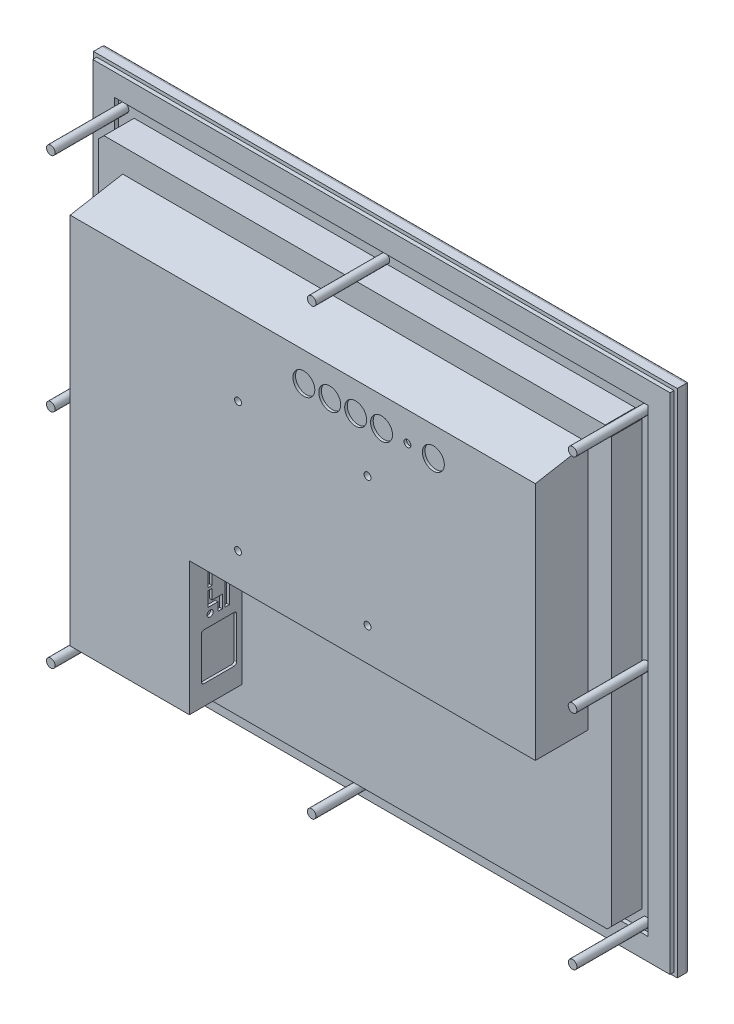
from build123d import *

# Parameters (mm, degrees)
SKETCH1_W                = 338.1248
SKETCH1_H                = 295.656
BEZEL_DEPTH              = 7.112
BEZEL_RADIUS_R           = 2
SKETCH2_W                = 249.3772
SKETCH2_H                = 187.9092
WINDOW_DEPTH             = 2.35
SKETCH3_W                = 334.320388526
SKETCH3_H                = 291.788581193
SKETCH3_W_2              = 308.920388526
SKETCH3_H_2              = 266.388357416
GASKET_DEPTH             = 2.3
SKETCH5_R                = 2.5
PANEL_FRAME_STUDS_DEPTH  = 42.7
BODY_DEPTH               = 17.4498
REAR_COVER_DEPTH         = 30.4038
REAR_COVER_SLOPE_ANGLE   = 10
F_4_0MM_VESA_HOLES_D     = 4
F_4_0MM_VESA_HOLES_DEPTH = 16.002
F_4_0MM_VESA_HOLES_TIP   = 1.201721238
SKETCH10_R               = 1.5875
VIDEO_TOUCH_DEPTH        = 1.524
SKETCH11_R               = 1.7907
SKETCH11_W               = 2.54
SKETCH11_H               = 27.94
POWER_AC_AND_DC_DEPTH    = 1.524
SKETCH12_R               = 6.35
SKETCH12_R_2             = 1.9812
CONTROLS_BUTTONS_DEPTH   = 1.524


with BuildPart() as part:
    # Sketch1 → Bezel (new body)
    with BuildSketch(Plane.XY):
        with Locations((328.195312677, 319.048766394)):
            Rectangle(SKETCH1_W, SKETCH1_H)
    extrude(amount=-BEZEL_DEPTH)

    # Bezel Radius
    bezel_radius_edges = [part.edges().sort_by_distance(p)[0] for p in [
        (497.257712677, 319.048766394, -7.112),
        (328.195312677, 466.876766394, -7.112),
        (159.132912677, 319.048766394, -7.112),
        (328.195312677, 171.220766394, -7.112),
    ]]
    fillet(bezel_radius_edges, radius=BEZEL_RADIUS_R)

    # Sketch2 → Window (cut)
    with BuildSketch(Plane(origin=(0, 0, -7.112), x_dir=(-1, 0, 0), z_dir=(0, 0, -1))):
        with Locations((-328.195312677, 319.810766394)):
            Rectangle(SKETCH2_W, SKETCH2_H)
    extrude(amount=-WINDOW_DEPTH, mode=Mode.SUBTRACT)

    # Sketch3 → Gasket (add)
    with BuildSketch(Plane.XY):
        with Locations((328.195312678, 319.048888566)):
            Rectangle(SKETCH3_W, SKETCH3_H)
        with Locations((328.195312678, 319.049000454)):
            Rectangle(SKETCH3_W_2, SKETCH3_H_2, mode=Mode.SUBTRACT)
    extrude(amount=GASKET_DEPTH)

    # Sketch5 → Panel Frame Studs (add)
    with BuildSketch(Plane.XY):
        with Locations(Location((177.108746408, 447.674484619, 0), (0, 0, 180))):
            Circle(SKETCH5_R)
        with Locations(Location((328.213346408, 447.674484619, 0), (0, 0, 180))):
            Circle(SKETCH5_R)
        with Locations(Location((479.317946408, 447.674484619, 0), (0, 0, 180))):
            Circle(SKETCH5_R)
        with Locations(Location((479.292546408, 319.044160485, 0), (0, 0, 180))):
            Circle(SKETCH5_R)
        with Locations(Location((479.317946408, 190.443960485, 0), (0, 0, 180))):
            Circle(SKETCH5_R)
        with Locations(Location((328.213346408, 190.443960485, 0), (0, 0, 180))):
            Circle(SKETCH5_R)
        with Locations(Location((177.108746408, 190.443960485, 0), (0, 0, 180))):
            Circle(SKETCH5_R)
        with Locations(Location((177.108746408, 319.044160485, 0), (0, 0, 180))):
            Circle(SKETCH5_R)
    extrude(amount=PANEL_FRAME_STUDS_DEPTH)

    # Sketch6 → Body (add)
    with BuildSketch(Plane.XY):
        Polygon((179.648746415, 442.086956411), (182.696747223, 445.134957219), (472.91398582, 445.134957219), (476.74187894, 441.307064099), (476.74187894, 195.604654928), (474.121184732, 192.98396072), (182.675840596, 192.98396072), (179.648746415, 196.011054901), align=None)
    extrude(amount=BODY_DEPTH)

    # Sketch7 → Rear Cover (add)
    with BuildSketch(Plane.XY.offset(17.4498)):
        Polygon((193.50647894, 425.90196072), (462.89887894, 425.90196072), (462.89887894, 287.06556072), (262.54367894, 287.06556072), (262.54367894, 209.79876072), (193.50647894, 209.79876072), align=None)
    extrude(amount=REAR_COVER_DEPTH)

    # Rear Cover Slope
    rear_cover_slope_faces = [part.faces().sort_by_distance(p)[0] for p in [
        (328.20267894, 425.90196072, 32.6517),
    ]]
    draft(rear_cover_slope_faces, Plane.XY.offset(47.8536), REAR_COVER_SLOPE_ANGLE)

    # 4.0mm VESA Holes
    with Locations(Plane.XY.offset(47.8536)):
        with Locations((290.71227894, 381.11556072), (365.71227894, 381.11556072), (365.71227894, 306.11556072), (290.71227894, 306.11556072)):
            Hole(F_4_0MM_VESA_HOLES_D / 2, depth=F_4_0MM_VESA_HOLES_DEPTH)
            with Locations((0, 0, -(F_4_0MM_VESA_HOLES_DEPTH + F_4_0MM_VESA_HOLES_TIP / 2))):  # 118° drill point
                Cone(0, F_4_0MM_VESA_HOLES_D / 2, F_4_0MM_VESA_HOLES_TIP, mode=Mode.SUBTRACT)

    # Sketch10 → Video _ Touch (cut)
    with BuildSketch(Plane(origin=(0, 287.06556072, 0), x_dir=(1, 0, 0), z_dir=(0, 1, 0))):
        with Locations((343.214078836, -30.48)):
            Circle(SKETCH10_R)
        with Locations((310.70207894, -30.48)):
            Circle(SKETCH10_R)
        with Locations((377.128478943, -32.004)):
            Circle(SKETCH10_R)
        with Locations((352.128485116, -32.004)):
            Circle(SKETCH10_R)
        with Locations((396.797907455, -30.48)):
            Circle(SKETCH10_R)
        with Locations((421.79790128, -30.48)):
            Circle(SKETCH10_R)
        with BuildLine():
            Line((340.620081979, -33.02), (340.620081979, -27.94))
            ThreePointArc((340.620081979, -27.94), (339.734607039, -25.740295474), (337.572081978, -24.767541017))
            Line((337.572081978, -24.767541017), (316.3440758, -24.767541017))
            ThreePointArc((316.3440758, -24.767541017), (314.181550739, -25.740295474), (313.296075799, -27.94))
            Line((313.296075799, -27.94), (313.296075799, -33.02))
            ThreePointArc((313.296075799, -33.02), (314.181550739, -35.219704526), (316.3440758, -36.192458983))
            Line((316.3440758, -36.192458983), (337.572081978, -36.192458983))
            ThreePointArc((337.572081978, -36.192458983), (339.734607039, -35.219704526), (340.620081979, -33.02))
        make_face()
        with BuildLine():
            Line((374.788442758, -29.4513), (374.788442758, -34.5313))
            ThreePointArc((374.788442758, -34.5313), (373.902967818, -36.731004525), (371.740442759, -37.703758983))
            Line((371.740442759, -37.703758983), (357.516442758, -37.703758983))
            ThreePointArc((357.516442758, -37.703758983), (355.353917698, -36.731004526), (354.468442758, -34.5313))
            Line((354.468442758, -34.5313), (354.468442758, -29.4513))
            ThreePointArc((354.468442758, -29.4513), (355.353917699, -27.251595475), (357.516442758, -26.278841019))
            Line((357.516442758, -26.278841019), (371.612870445, -26.276300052))
            ThreePointArc((371.612870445, -26.276300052), (373.858304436, -27.206033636), (374.788442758, -29.4513))
        make_face()
        with BuildLine():
            Line((399.137865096, -27.952699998), (399.137865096, -33.0327))
            ThreePointArc((399.137865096, -33.0327), (400.023340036, -35.232404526), (402.185865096, -36.205158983))
            Line((402.185865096, -36.205158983), (416.282292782, -36.207699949))
            ThreePointArc((416.282292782, -36.207699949), (418.527726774, -35.277966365), (419.457865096, -33.0327))
            Line((419.457865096, -33.0327), (419.457865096, -27.9527))
            ThreePointArc((419.457865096, -27.9527), (418.572390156, -25.752995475), (416.409865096, -24.780241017))
            Line((416.409865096, -24.780241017), (402.185865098, -24.780241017))
            ThreePointArc((402.185865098, -24.780241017), (400.023340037, -25.752995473), (399.137865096, -27.952699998))
        make_face()
        with BuildLine():
            Line((451.076477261, -24.384), (435.074477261, -24.384))
            Line((435.074477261, -24.384), (435.074477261, -28.8925))
            Line((435.074477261, -28.8925), (430.629477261, -28.8925))
            ThreePointArc((430.629477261, -28.8925), (429.041977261, -30.48), (430.629477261, -32.0675))
            Line((430.629477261, -32.0675), (435.074477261, -32.0675))
            Line((435.074477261, -32.0675), (435.074477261, -36.576))
            Line((435.074477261, -36.576), (451.076477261, -36.576))
            Line((451.076477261, -36.576), (451.076477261, -32.0675))
            Line((451.076477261, -32.0675), (455.521477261, -32.0675))
            ThreePointArc((455.521477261, -32.0675), (457.108977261, -30.48), (455.521477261, -28.8925))
            Line((455.521477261, -28.8925), (451.076477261, -28.8925))
            Line((451.076477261, -28.8925), (451.076477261, -24.384))
        make_face()
    extrude(amount=VIDEO_TOUCH_DEPTH, mode=Mode.SUBTRACT)

    # Sketch11 → Power AC and DC (cut)
    with BuildSketch(Plane.ZY.offset(-262.54367894)):
        with Locations(Location((35.814, 254.60436072, 0), (0, 0, 180))):
            Circle(SKETCH11_R)
        with Locations(Location((35.814, 280.18216072, 0), (0, 0, 180))):
            Circle(SKETCH11_R)
        Polygon((31.3182, 253.42326072), (31.3182, 258.23656072), (37.211, 258.23656072), (37.211, 266.63126072), (34.671, 266.63126072), (34.671, 260.77656072), (28.7782, 260.77656072), (28.7782, 253.42326072), align=None)
        with Locations((25.9842, 267.39326072)):
            Rectangle(SKETCH11_W, SKETCH11_H)
        Polygon((28.7782, 281.36326072), (31.3182, 281.36326072), (31.3182, 276.54996072), (37.211, 276.54996072), (37.211, 268.15526072), (34.671, 268.15526072), (34.671, 274.00996072), (28.7782, 274.00996072), align=None)
        with BuildLine():
            Line((20.459943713, 246.691103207), (20.459943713, 222.751604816))
            ThreePointArc((20.459943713, 222.751604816), (20.905759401, 221.674527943), (21.982377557, 221.22760562))
            Line((21.982377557, 221.22760562), (39.433752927, 221.22760562))
            ThreePointArc((39.433752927, 221.22760562), (40.511383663, 221.673974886), (40.957752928, 222.751605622))
            Line((40.957752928, 222.751605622), (40.957752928, 246.691104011))
            ThreePointArc((40.957752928, 246.691104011), (40.51193724, 247.768180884), (39.435319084, 248.215103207))
            Line((39.435319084, 248.215103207), (21.983943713, 248.215103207))
            ThreePointArc((21.983943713, 248.215103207), (20.906312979, 247.768733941), (20.459943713, 246.691103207))
        make_face()
    extrude(amount=POWER_AC_AND_DC_DEPTH, mode=Mode.SUBTRACT)

    # Sketch12 → Controls Buttons (cut)
    with BuildSketch(Plane.XY.offset(47.8536)):
        with Locations((328.83147894, 409.03016072)):
            Circle(SKETCH12_R)
        with Locations((343.83147894, 409.03016072)):
            Circle(SKETCH12_R)
        with Locations((358.83147894, 409.03016072)):
            Circle(SKETCH12_R)
        with Locations((373.83147894, 409.03016072)):
            Circle(SKETCH12_R)
        with Locations((388.83147894, 409.03016072)):
            Circle(SKETCH12_R_2)
        with Locations((403.831478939, 409.03016072)):
            Circle(SKETCH12_R)
    extrude(amount=-CONTROLS_BUTTONS_DEPTH, mode=Mode.SUBTRACT)


solid = part.part
